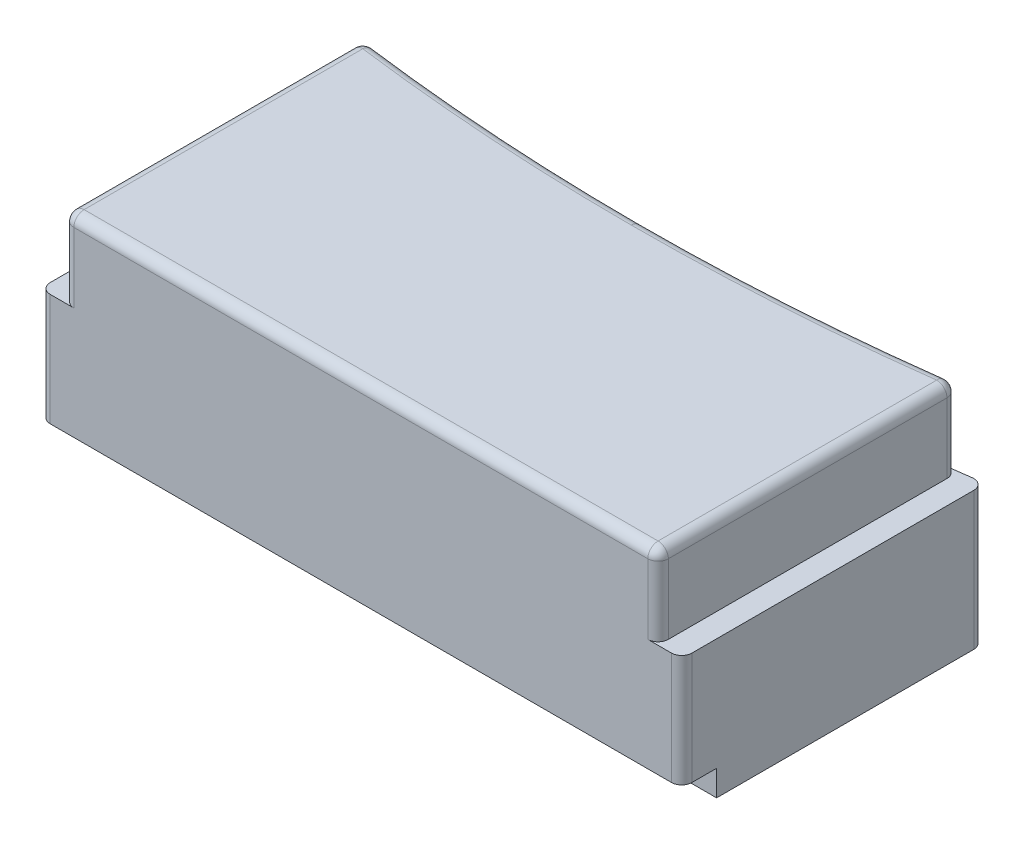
ISO-10303-21;
HEADER;
FILE_DESCRIPTION(('STEP AP214'),'2;1');
FILE_NAME('part.step','',(''),(''),'','','');
FILE_SCHEMA(('AUTOMOTIVE_DESIGN { 1 0 10303 214 1 1 1 1 }'));
ENDSEC;
DATA;
#1=APPLICATION_CONTEXT('core data for automotive mechanical design processes');
#2=APPLICATION_PROTOCOL_DEFINITION('international standard','automotive_design',2000,#1);
#3=PRODUCT_CONTEXT('',#1,'mechanical');
#4=PRODUCT('Part','Part','',(#3));
#5=PRODUCT_RELATED_PRODUCT_CATEGORY('part','',(#4));
#6=PRODUCT_DEFINITION_FORMATION('','',#4);
#7=PRODUCT_DEFINITION_CONTEXT('part definition',#1,'design');
#8=PRODUCT_DEFINITION('design','',#6,#7);
#9=PRODUCT_DEFINITION_SHAPE('','',#8);
#10=(LENGTH_UNIT() NAMED_UNIT(*) SI_UNIT(.MILLI.,.METRE.));
#11=(NAMED_UNIT(*) PLANE_ANGLE_UNIT() SI_UNIT($,.RADIAN.));
#12=(NAMED_UNIT(*) SI_UNIT($,.STERADIAN.) SOLID_ANGLE_UNIT());
#13=UNCERTAINTY_MEASURE_WITH_UNIT(LENGTH_MEASURE(1.E-05),#10,'distance_accuracy_value','');
#14=(GEOMETRIC_REPRESENTATION_CONTEXT(3) GLOBAL_UNCERTAINTY_ASSIGNED_CONTEXT((#13)) GLOBAL_UNIT_ASSIGNED_CONTEXT((#10,
#11,#12)) REPRESENTATION_CONTEXT('',''));
#15=CARTESIAN_POINT('',(0.,0.,0.));
#16=DIRECTION('',(0.,0.,1.));
#17=DIRECTION('',(1.,0.,0.));
#18=AXIS2_PLACEMENT_3D('',#15,#16,#17);
#19=CARTESIAN_POINT('',(-27.9500000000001,9.61,-1.));
#20=DIRECTION('',(1.,0.,0.));
#21=DIRECTION('',(0.,0.,-1.));
#22=AXIS2_PLACEMENT_3D('',#19,#20,#21);
#23=SPHERICAL_SURFACE('',#22,1.);
#24=CARTESIAN_POINT('',(-27.9500000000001,9.61,-1.));
#25=DIRECTION('',(-1.,0.,0.));
#26=DIRECTION('',(0.,0.,1.));
#27=AXIS2_PLACEMENT_3D('',#24,#25,#26);
#28=CIRCLE('',#27,1.);
#29=CARTESIAN_POINT('',(-27.9500000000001,10.61,-1.));
#30=VERTEX_POINT('',#29);
#31=CARTESIAN_POINT('',(-27.9500000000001,9.61,0.));
#32=VERTEX_POINT('',#31);
#33=EDGE_CURVE('E259',#30,#32,#28,.F.);
#34=ORIENTED_EDGE('',*,*,#33,.F.);
#35=CARTESIAN_POINT('',(-27.9500000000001,9.61,-1.));
#36=DIRECTION('',(0.,0.,1.));
#37=DIRECTION('',(1.,0.,0.));
#38=AXIS2_PLACEMENT_3D('',#35,#36,#37);
#39=CIRCLE('',#38,1.);
#40=CARTESIAN_POINT('',(-28.9500000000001,9.61,-1.));
#41=VERTEX_POINT('',#40);
#42=EDGE_CURVE('E258',#41,#30,#39,.F.);
#43=ORIENTED_EDGE('',*,*,#42,.F.);
#44=CARTESIAN_POINT('',(-27.9500000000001,9.61,-1.));
#45=DIRECTION('',(0.,1.,0.));
#46=DIRECTION('',(0.,0.,1.));
#47=AXIS2_PLACEMENT_3D('',#44,#45,#46);
#48=CIRCLE('',#47,1.);
#49=EDGE_CURVE('E233',#32,#41,#48,.F.);
#50=ORIENTED_EDGE('',*,*,#49,.F.);
#51=EDGE_LOOP('',(#34,#43,#50));
#52=FACE_BOUND('',#51,.T.);
#53=ADVANCED_FACE('F39',(#52),#23,.T.);
#54=CARTESIAN_POINT('',(27.9500000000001,9.61,-1.));
#55=DIRECTION('',(1.,0.,0.));
#56=DIRECTION('',(0.,0.,-1.));
#57=AXIS2_PLACEMENT_3D('',#54,#55,#56);
#58=SPHERICAL_SURFACE('',#57,1.);
#59=CARTESIAN_POINT('',(27.9500000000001,9.61,-1.));
#60=DIRECTION('',(0.,1.,0.));
#61=DIRECTION('',(0.,0.,1.));
#62=AXIS2_PLACEMENT_3D('',#59,#60,#61);
#63=CIRCLE('',#62,1.);
#64=CARTESIAN_POINT('',(28.9500000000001,9.61,-1.));
#65=VERTEX_POINT('',#64);
#66=CARTESIAN_POINT('',(27.9500000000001,9.61,0.));
#67=VERTEX_POINT('',#66);
#68=EDGE_CURVE('E600',#65,#67,#63,.F.);
#69=ORIENTED_EDGE('',*,*,#68,.F.);
#70=CARTESIAN_POINT('',(27.9500000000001,9.61,-1.));
#71=DIRECTION('',(0.,0.,-1.));
#72=DIRECTION('',(-1.,0.,0.));
#73=AXIS2_PLACEMENT_3D('',#70,#71,#72);
#74=CIRCLE('',#73,1.);
#75=CARTESIAN_POINT('',(27.9500000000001,10.61,-1.));
#76=VERTEX_POINT('',#75);
#77=EDGE_CURVE('E264',#76,#65,#74,.T.);
#78=ORIENTED_EDGE('',*,*,#77,.F.);
#79=CARTESIAN_POINT('',(27.9500000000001,9.61,-1.));
#80=DIRECTION('',(-1.,0.,0.));
#81=DIRECTION('',(0.,0.,1.));
#82=AXIS2_PLACEMENT_3D('',#79,#80,#81);
#83=CIRCLE('',#82,1.);
#84=EDGE_CURVE('E244',#67,#76,#83,.T.);
#85=ORIENTED_EDGE('',*,*,#84,.F.);
#86=EDGE_LOOP('',(#69,#78,#85));
#87=FACE_BOUND('',#86,.T.);
#88=ADVANCED_FACE('F290',(#87),#58,.T.);
#89=CARTESIAN_POINT('',(27.9500000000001,9.61,0.));
#90=DIRECTION('',(0.,0.,-1.));
#91=DIRECTION('',(-1.,0.,0.));
#92=AXIS2_PLACEMENT_3D('',#89,#90,#91);
#93=CYLINDRICAL_SURFACE('',#92,1.);
#94=CARTESIAN_POINT('',(27.9500000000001,9.61,-28.1372404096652));
#95=DIRECTION('',(0.,0.,1.));
#96=DIRECTION('',(1.,0.,0.));
#97=AXIS2_PLACEMENT_3D('',#94,#95,#96);
#98=CIRCLE('',#97,1.);
#99=CARTESIAN_POINT('',(27.9500000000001,10.61,-28.1372404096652));
#100=VERTEX_POINT('',#99);
#101=CARTESIAN_POINT('',(28.9500000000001,9.61,-28.1372404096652));
#102=VERTEX_POINT('',#101);
#103=EDGE_CURVE('E333',#100,#102,#98,.F.);
#104=ORIENTED_EDGE('',*,*,#103,.F.);
#105=DIRECTION('',(0.,0.,1.));
#106=VECTOR('',#105,1.);
#107=CARTESIAN_POINT('',(27.9500000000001,10.61,-244.338067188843));
#108=LINE('',#107,#106);
#109=EDGE_CURVE('E588',#76,#100,#108,.F.);
#110=ORIENTED_EDGE('',*,*,#109,.F.);
#111=ORIENTED_EDGE('',*,*,#77,.T.);
#112=DIRECTION('',(0.,0.,1.));
#113=VECTOR('',#112,1.);
#114=CARTESIAN_POINT('',(28.9500000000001,9.61,0.));
#115=LINE('',#114,#113);
#116=EDGE_CURVE('E282',#65,#102,#115,.F.);
#117=ORIENTED_EDGE('',*,*,#116,.T.);
#118=EDGE_LOOP('',(#104,#110,#111,#117));
#119=FACE_BOUND('',#118,.T.);
#120=ADVANCED_FACE('F293',(#119),#93,.T.);
#121=CARTESIAN_POINT('',(-27.9500000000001,9.61,0.));
#122=DIRECTION('',(0.,0.,1.));
#123=DIRECTION('',(1.,0.,0.));
#124=AXIS2_PLACEMENT_3D('',#121,#122,#123);
#125=CYLINDRICAL_SURFACE('',#124,1.);
#126=CARTESIAN_POINT('',(-27.9500000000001,9.61,-28.1372404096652));
#127=DIRECTION('',(0.,9.81293437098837E-11,1.));
#128=DIRECTION('',(1.,0.,0.));
#129=AXIS2_PLACEMENT_3D('',#126,#127,#128);
#130=CIRCLE('',#129,1.);
#131=CARTESIAN_POINT('',(-28.9500000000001,9.61,-28.1372404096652));
#132=VERTEX_POINT('',#131);
#133=CARTESIAN_POINT('',(-27.9500000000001,10.61,-28.1372404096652));
#134=VERTEX_POINT('',#133);
#135=EDGE_CURVE('E267',#132,#134,#130,.F.);
#136=ORIENTED_EDGE('',*,*,#135,.F.);
#137=DIRECTION('',(0.,0.,-1.));
#138=VECTOR('',#137,1.);
#139=CARTESIAN_POINT('',(-28.9500000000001,9.61,0.));
#140=LINE('',#139,#138);
#141=EDGE_CURVE('E251',#132,#41,#140,.F.);
#142=ORIENTED_EDGE('',*,*,#141,.T.);
#143=ORIENTED_EDGE('',*,*,#42,.T.);
#144=DIRECTION('',(0.,0.,1.));
#145=VECTOR('',#144,1.);
#146=CARTESIAN_POINT('',(-27.9500000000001,10.61,-244.338067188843));
#147=LINE('',#146,#145);
#148=EDGE_CURVE('E585',#134,#30,#147,.T.);
#149=ORIENTED_EDGE('',*,*,#148,.F.);
#150=EDGE_LOOP('',(#136,#142,#143,#149));
#151=FACE_BOUND('',#150,.T.);
#152=ADVANCED_FACE('F266',(#151),#125,.T.);
#153=CARTESIAN_POINT('',(-27.9500000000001,2.81,-1.));
#154=DIRECTION('',(0.,1.,0.));
#155=DIRECTION('',(0.,0.,1.));
#156=AXIS2_PLACEMENT_3D('',#153,#154,#155);
#157=CYLINDRICAL_SURFACE('',#156,1.);
#158=ORIENTED_EDGE('',*,*,#49,.T.);
#159=DIRECTION('',(0.,1.,0.));
#160=VECTOR('',#159,1.);
#161=CARTESIAN_POINT('',(-28.9500000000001,2.81,-1.));
#162=LINE('',#161,#160);
#163=CARTESIAN_POINT('',(-28.9500000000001,2.81,-1.));
#164=VERTEX_POINT('',#163);
#165=EDGE_CURVE('E236',#41,#164,#162,.F.);
#166=ORIENTED_EDGE('',*,*,#165,.T.);
#167=CARTESIAN_POINT('',(-27.9500000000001,2.81,-1.));
#168=DIRECTION('',(0.,1.,0.));
#169=DIRECTION('',(0.,0.,1.));
#170=AXIS2_PLACEMENT_3D('',#167,#168,#169);
#171=CIRCLE('',#170,1.);
#172=CARTESIAN_POINT('',(-27.9500000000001,2.81,0.));
#173=VERTEX_POINT('',#172);
#174=EDGE_CURVE('E43',#164,#173,#171,.T.);
#175=ORIENTED_EDGE('',*,*,#174,.T.);
#176=DIRECTION('',(0.,1.,0.));
#177=VECTOR('',#176,1.);
#178=CARTESIAN_POINT('',(-27.9500000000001,10.61,0.));
#179=LINE('',#178,#177);
#180=EDGE_CURVE('E238',#173,#32,#179,.T.);
#181=ORIENTED_EDGE('',*,*,#180,.T.);
#182=EDGE_LOOP('',(#158,#166,#175,#181));
#183=FACE_BOUND('',#182,.T.);
#184=ADVANCED_FACE('F235',(#183),#157,.T.);
#185=CARTESIAN_POINT('',(0.,9.61,-1.));
#186=DIRECTION('',(-1.,0.,0.));
#187=DIRECTION('',(0.,0.,1.));
#188=AXIS2_PLACEMENT_3D('',#185,#186,#187);
#189=CYLINDRICAL_SURFACE('',#188,1.);
#190=ORIENTED_EDGE('',*,*,#33,.T.);
#191=DIRECTION('',(-1.,0.,0.));
#192=VECTOR('',#191,1.);
#193=CARTESIAN_POINT('',(-31.25,9.61,0.));
#194=LINE('',#193,#192);
#195=EDGE_CURVE('E274',#32,#67,#194,.F.);
#196=ORIENTED_EDGE('',*,*,#195,.T.);
#197=ORIENTED_EDGE('',*,*,#84,.T.);
#198=DIRECTION('',(1.,0.,0.));
#199=VECTOR('',#198,1.);
#200=CARTESIAN_POINT('',(0.,10.61,-1.));
#201=LINE('',#200,#199);
#202=EDGE_CURVE('E593',#30,#76,#201,.T.);
#203=ORIENTED_EDGE('',*,*,#202,.F.);
#204=EDGE_LOOP('',(#190,#196,#197,#203));
#205=FACE_BOUND('',#204,.T.);
#206=ADVANCED_FACE('F302',(#205),#189,.T.);
#207=CARTESIAN_POINT('',(27.9500000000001,10.61,-1.));
#208=DIRECTION('',(0.,1.,0.));
#209=DIRECTION('',(0.,0.,1.));
#210=AXIS2_PLACEMENT_3D('',#207,#208,#209);
#211=CYLINDRICAL_SURFACE('',#210,1.);
#212=CARTESIAN_POINT('',(27.9500000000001,2.81,-1.));
#213=DIRECTION('',(0.,1.,0.));
#214=DIRECTION('',(0.,0.,1.));
#215=AXIS2_PLACEMENT_3D('',#212,#213,#214);
#216=CIRCLE('',#215,1.);
#217=CARTESIAN_POINT('',(27.9500000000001,2.81,0.));
#218=VERTEX_POINT('',#217);
#219=CARTESIAN_POINT('',(28.9500000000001,2.81,-1.));
#220=VERTEX_POINT('',#219);
#221=EDGE_CURVE('E598',#218,#220,#216,.T.);
#222=ORIENTED_EDGE('',*,*,#221,.T.);
#223=DIRECTION('',(0.,1.,0.));
#224=VECTOR('',#223,1.);
#225=CARTESIAN_POINT('',(28.9500000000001,2.81,-1.));
#226=LINE('',#225,#224);
#227=EDGE_CURVE('E286',#220,#65,#226,.T.);
#228=ORIENTED_EDGE('',*,*,#227,.T.);
#229=ORIENTED_EDGE('',*,*,#68,.T.);
#230=DIRECTION('',(0.,1.,0.));
#231=VECTOR('',#230,1.);
#232=CARTESIAN_POINT('',(27.9500000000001,10.61,0.));
#233=LINE('',#232,#231);
#234=EDGE_CURVE('E425',#67,#218,#233,.F.);
#235=ORIENTED_EDGE('',*,*,#234,.T.);
#236=EDGE_LOOP('',(#222,#228,#229,#235));
#237=FACE_BOUND('',#236,.T.);
#238=ADVANCED_FACE('F305',(#237),#211,.T.);
#239=CARTESIAN_POINT('',(28.9500000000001,2.81,0.));
#240=DIRECTION('',(-1.,0.,0.));
#241=DIRECTION('',(0.,0.,1.));
#242=AXIS2_PLACEMENT_3D('',#239,#240,#241);
#243=PLANE('',#242);
#244=DIRECTION('',(0.,-1.,0.));
#245=VECTOR('',#244,1.);
#246=CARTESIAN_POINT('',(28.9500000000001,10.61,-28.1372404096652));
#247=LINE('',#246,#245);
#248=CARTESIAN_POINT('',(28.9500000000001,2.81,-28.1372404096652));
#249=VERTEX_POINT('',#248);
#250=EDGE_CURVE('E285',#102,#249,#247,.T.);
#251=ORIENTED_EDGE('',*,*,#250,.F.);
#252=ORIENTED_EDGE('',*,*,#116,.F.);
#253=ORIENTED_EDGE('',*,*,#227,.F.);
#254=DIRECTION('',(0.,0.,-1.));
#255=VECTOR('',#254,1.);
#256=CARTESIAN_POINT('',(28.9500000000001,2.81,0.));
#257=LINE('',#256,#255);
#258=EDGE_CURVE('E384',#220,#249,#257,.T.);
#259=ORIENTED_EDGE('',*,*,#258,.T.);
#260=EDGE_LOOP('',(#251,#252,#253,#259));
#261=FACE_BOUND('',#260,.T.);
#262=ADVANCED_FACE('F309',(#261),#243,.F.);
#263=CARTESIAN_POINT('',(27.9500000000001,10.61,-28.1372404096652));
#264=DIRECTION('',(0.,-1.,0.));
#265=DIRECTION('',(0.,0.,-1.));
#266=AXIS2_PLACEMENT_3D('',#263,#264,#265);
#267=CYLINDRICAL_SURFACE('',#266,1.);
#268=ORIENTED_EDGE('',*,*,#250,.T.);
#269=CARTESIAN_POINT('',(27.9500000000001,2.81,-28.1372404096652));
#270=DIRECTION('',(0.,-1.,0.));
#271=DIRECTION('',(0.,0.,-1.));
#272=AXIS2_PLACEMENT_3D('',#269,#270,#271);
#273=CIRCLE('',#272,1.);
#274=CARTESIAN_POINT('',(27.9500000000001,2.81,-29.1372404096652));
#275=VERTEX_POINT('',#274);
#276=EDGE_CURVE('E388',#249,#275,#273,.F.);
#277=ORIENTED_EDGE('',*,*,#276,.T.);
#278=DIRECTION('',(0.,-1.,0.));
#279=VECTOR('',#278,1.);
#280=CARTESIAN_POINT('',(27.9500000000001,10.61,-29.1372404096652));
#281=LINE('',#280,#279);
#282=CARTESIAN_POINT('',(27.9500000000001,9.61,-29.1372404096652));
#283=VERTEX_POINT('',#282);
#284=EDGE_CURVE('E351',#283,#275,#281,.T.);
#285=ORIENTED_EDGE('',*,*,#284,.F.);
#286=CARTESIAN_POINT('',(27.9500000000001,9.61,-28.1372404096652));
#287=DIRECTION('',(0.,1.,0.));
#288=DIRECTION('',(1.,0.,0.));
#289=AXIS2_PLACEMENT_3D('',#286,#287,#288);
#290=CIRCLE('',#289,1.);
#291=EDGE_CURVE('E337',#102,#283,#290,.T.);
#292=ORIENTED_EDGE('',*,*,#291,.F.);
#293=EDGE_LOOP('',(#268,#277,#285,#292));
#294=FACE_BOUND('',#293,.T.);
#295=ADVANCED_FACE('F313',(#294),#267,.T.);
#296=CARTESIAN_POINT('',(27.9500000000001,9.61,-28.1372404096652));
#297=DIRECTION('',(1.,0.,0.));
#298=DIRECTION('',(0.,0.,-1.));
#299=AXIS2_PLACEMENT_3D('',#296,#297,#298);
#300=SPHERICAL_SURFACE('',#299,1.);
#301=CARTESIAN_POINT('',(27.9500000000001,9.61,-28.1372404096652));
#302=DIRECTION('',(0.,-1.,0.));
#303=DIRECTION('',(0.,0.,-1.));
#304=AXIS2_PLACEMENT_3D('',#301,#302,#303);
#305=CIRCLE('',#304,1.);
#306=CARTESIAN_POINT('',(27.8217889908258,9.61,-29.1289873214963));
#307=VERTEX_POINT('',#306);
#308=EDGE_CURVE('E379',#307,#283,#305,.T.);
#309=ORIENTED_EDGE('',*,*,#308,.F.);
#310=CARTESIAN_POINT('',(27.9500000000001,9.61,-28.1372404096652));
#311=DIRECTION('',(0.99174691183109,0.,-0.128211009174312));
#312=DIRECTION('',(0.128211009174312,0.,0.99174691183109));
#313=AXIS2_PLACEMENT_3D('',#310,#311,#312);
#314=CIRCLE('',#313,1.);
#315=EDGE_CURVE('E546',#100,#307,#314,.F.);
#316=ORIENTED_EDGE('',*,*,#315,.F.);
#317=ORIENTED_EDGE('',*,*,#103,.T.);
#318=ORIENTED_EDGE('',*,*,#291,.T.);
#319=EDGE_LOOP('',(#309,#316,#317,#318));
#320=FACE_BOUND('',#319,.T.);
#321=ADVANCED_FACE('F317',(#320),#300,.T.);
#322=CARTESIAN_POINT('',(0.,10.61,-244.338067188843));
#323=DIRECTION('',(0.,1.,0.));
#324=DIRECTION('',(0.,0.,1.));
#325=AXIS2_PLACEMENT_3D('',#322,#323,#324);
#326=PLANE('',#325);
#327=CARTESIAN_POINT('',(0.,10.61,-244.338067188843));
#328=DIRECTION('',(0.,1.,0.));
#329=DIRECTION('',(-0.128211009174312,0.,0.99174691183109));
#330=AXIS2_PLACEMENT_3D('',#327,#328,#329);
#331=CIRCLE('',#330,218.);
#332=CARTESIAN_POINT('',(0.,10.61,-26.3380671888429));
#333=VERTEX_POINT('',#332);
#334=EDGE_CURVE('E537',#134,#333,#331,.T.);
#335=ORIENTED_EDGE('',*,*,#334,.F.);
#336=ORIENTED_EDGE('',*,*,#148,.T.);
#337=ORIENTED_EDGE('',*,*,#202,.T.);
#338=ORIENTED_EDGE('',*,*,#109,.T.);
#339=CARTESIAN_POINT('',(0.,10.61,-244.338067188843));
#340=DIRECTION('',(0.,1.,0.));
#341=DIRECTION('',(0.,0.,1.));
#342=AXIS2_PLACEMENT_3D('',#339,#340,#341);
#343=CIRCLE('',#342,218.);
#344=EDGE_CURVE('E345',#333,#100,#343,.T.);
#345=ORIENTED_EDGE('',*,*,#344,.F.);
#346=EDGE_LOOP('',(#335,#336,#337,#338,#345));
#347=FACE_BOUND('',#346,.T.);
#348=ADVANCED_FACE('F322',(#347),#326,.T.);
#349=CARTESIAN_POINT('',(-27.9500000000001,9.61,-28.1372404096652));
#350=DIRECTION('',(1.,0.,0.));
#351=DIRECTION('',(0.,0.,-1.));
#352=AXIS2_PLACEMENT_3D('',#349,#350,#351);
#353=SPHERICAL_SURFACE('',#352,1.);
#354=CARTESIAN_POINT('',(-27.9500000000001,9.61,-28.1372404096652));
#355=DIRECTION('',(0.,1.,0.));
#356=DIRECTION('',(1.,0.,0.));
#357=AXIS2_PLACEMENT_3D('',#354,#355,#356);
#358=CIRCLE('',#357,1.);
#359=CARTESIAN_POINT('',(-27.8217889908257,9.61,-29.1289873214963));
#360=VERTEX_POINT('',#359);
#361=CARTESIAN_POINT('',(-27.9500000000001,9.61,-29.1372404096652));
#362=VERTEX_POINT('',#361);
#363=EDGE_CURVE('E430',#360,#362,#358,.T.);
#364=ORIENTED_EDGE('',*,*,#363,.T.);
#365=CARTESIAN_POINT('',(-27.9500000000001,9.61,-28.1372404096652));
#366=DIRECTION('',(0.,-1.,0.));
#367=DIRECTION('',(0.,0.,-1.));
#368=AXIS2_PLACEMENT_3D('',#365,#366,#367);
#369=CIRCLE('',#368,1.);
#370=EDGE_CURVE('E426',#132,#362,#369,.T.);
#371=ORIENTED_EDGE('',*,*,#370,.F.);
#372=ORIENTED_EDGE('',*,*,#135,.T.);
#373=CARTESIAN_POINT('',(-27.9500000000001,9.61,-28.1372404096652));
#374=DIRECTION('',(0.99174691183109,0.,0.128211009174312));
#375=DIRECTION('',(-0.128211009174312,0.,0.99174691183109));
#376=AXIS2_PLACEMENT_3D('',#373,#374,#375);
#377=CIRCLE('',#376,1.);
#378=EDGE_CURVE('E420',#360,#134,#377,.T.);
#379=ORIENTED_EDGE('',*,*,#378,.F.);
#380=EDGE_LOOP('',(#364,#371,#372,#379));
#381=FACE_BOUND('',#380,.T.);
#382=ADVANCED_FACE('F434',(#381),#353,.T.);
#383=CARTESIAN_POINT('',(-27.9500000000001,10.61,-28.1372404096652));
#384=DIRECTION('',(0.,-1.,0.));
#385=DIRECTION('',(0.,0.,-1.));
#386=AXIS2_PLACEMENT_3D('',#383,#384,#385);
#387=CYLINDRICAL_SURFACE('',#386,1.);
#388=CARTESIAN_POINT('',(-27.9500000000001,2.81,-28.1372404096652));
#389=DIRECTION('',(0.,-1.,0.));
#390=DIRECTION('',(0.,0.,-1.));
#391=AXIS2_PLACEMENT_3D('',#388,#389,#390);
#392=CIRCLE('',#391,1.);
#393=CARTESIAN_POINT('',(-27.9500000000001,2.81,-29.1372404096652));
#394=VERTEX_POINT('',#393);
#395=CARTESIAN_POINT('',(-28.9500000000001,2.81,-28.1372404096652));
#396=VERTEX_POINT('',#395);
#397=EDGE_CURVE('E256',#394,#396,#392,.F.);
#398=ORIENTED_EDGE('',*,*,#397,.T.);
#399=DIRECTION('',(0.,1.,0.));
#400=VECTOR('',#399,1.);
#401=CARTESIAN_POINT('',(-28.9500000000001,2.81,-28.1372404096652));
#402=LINE('',#401,#400);
#403=EDGE_CURVE('E255',#396,#132,#402,.T.);
#404=ORIENTED_EDGE('',*,*,#403,.T.);
#405=ORIENTED_EDGE('',*,*,#370,.T.);
#406=DIRECTION('',(0.,-1.,0.));
#407=VECTOR('',#406,1.);
#408=CARTESIAN_POINT('',(-27.9500000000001,10.61,-29.1372404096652));
#409=LINE('',#408,#407);
#410=EDGE_CURVE('E416',#394,#362,#409,.F.);
#411=ORIENTED_EDGE('',*,*,#410,.F.);
#412=EDGE_LOOP('',(#398,#404,#405,#411));
#413=FACE_BOUND('',#412,.T.);
#414=ADVANCED_FACE('F437',(#413),#387,.T.);
#415=CARTESIAN_POINT('',(-28.9500000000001,2.81,0.));
#416=DIRECTION('',(1.,0.,0.));
#417=DIRECTION('',(0.,0.,-1.));
#418=AXIS2_PLACEMENT_3D('',#415,#416,#417);
#419=PLANE('',#418);
#420=ORIENTED_EDGE('',*,*,#403,.F.);
#421=DIRECTION('',(0.,0.,-1.));
#422=VECTOR('',#421,1.);
#423=CARTESIAN_POINT('',(-28.9500000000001,2.81,0.));
#424=LINE('',#423,#422);
#425=EDGE_CURVE('E253',#396,#164,#424,.F.);
#426=ORIENTED_EDGE('',*,*,#425,.T.);
#427=ORIENTED_EDGE('',*,*,#165,.F.);
#428=ORIENTED_EDGE('',*,*,#141,.F.);
#429=EDGE_LOOP('',(#420,#426,#427,#428));
#430=FACE_BOUND('',#429,.T.);
#431=ADVANCED_FACE('F249',(#430),#419,.F.);
#432=CARTESIAN_POINT('',(-31.25,10.61,0.));
#433=DIRECTION('',(0.,0.,-1.));
#434=DIRECTION('',(-1.,0.,0.));
#435=AXIS2_PLACEMENT_3D('',#432,#433,#434);
#436=PLANE('',#435);
#437=DIRECTION('',(0.,-1.,0.));
#438=VECTOR('',#437,1.);
#439=CARTESIAN_POINT('',(-30.25,10.61,0.));
#440=LINE('',#439,#438);
#441=CARTESIAN_POINT('',(-30.25,-8.11,0.));
#442=VERTEX_POINT('',#441);
#443=CARTESIAN_POINT('',(-30.25,2.81,0.));
#444=VERTEX_POINT('',#443);
#445=EDGE_CURVE('E166',#442,#444,#440,.F.);
#446=ORIENTED_EDGE('',*,*,#445,.F.);
#447=DIRECTION('',(1.,0.,0.));
#448=VECTOR('',#447,1.);
#449=CARTESIAN_POINT('',(-31.2500000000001,-8.11,0.));
#450=LINE('',#449,#448);
#451=CARTESIAN_POINT('',(30.25,-8.11,0.));
#452=VERTEX_POINT('',#451);
#453=EDGE_CURVE('E411',#442,#452,#450,.T.);
#454=ORIENTED_EDGE('',*,*,#453,.T.);
#455=DIRECTION('',(0.,-1.,0.));
#456=VECTOR('',#455,1.);
#457=CARTESIAN_POINT('',(30.25,10.61,0.));
#458=LINE('',#457,#456);
#459=CARTESIAN_POINT('',(30.25,2.81,0.));
#460=VERTEX_POINT('',#459);
#461=EDGE_CURVE('E421',#460,#452,#458,.T.);
#462=ORIENTED_EDGE('',*,*,#461,.F.);
#463=DIRECTION('',(1.,0.,0.));
#464=VECTOR('',#463,1.);
#465=CARTESIAN_POINT('',(0.,2.81,0.));
#466=LINE('',#465,#464);
#467=EDGE_CURVE('E389',#460,#218,#466,.F.);
#468=ORIENTED_EDGE('',*,*,#467,.T.);
#469=ORIENTED_EDGE('',*,*,#234,.F.);
#470=ORIENTED_EDGE('',*,*,#195,.F.);
#471=ORIENTED_EDGE('',*,*,#180,.F.);
#472=DIRECTION('',(1.,0.,0.));
#473=VECTOR('',#472,1.);
#474=CARTESIAN_POINT('',(0.,2.81,0.));
#475=LINE('',#474,#473);
#476=EDGE_CURVE('E653',#173,#444,#475,.F.);
#477=ORIENTED_EDGE('',*,*,#476,.T.);
#478=EDGE_LOOP('',(#446,#454,#462,#468,#469,#470,#471,#477));
#479=FACE_BOUND('',#478,.T.);
#480=ADVANCED_FACE('F444',(#479),#436,.F.);
#481=CARTESIAN_POINT('',(30.25,10.61,-1.));
#482=DIRECTION('',(0.,-1.,0.));
#483=DIRECTION('',(0.,0.,-1.));
#484=AXIS2_PLACEMENT_3D('',#481,#482,#483);
#485=CYLINDRICAL_SURFACE('',#484,1.);
#486=CARTESIAN_POINT('',(30.25,-8.11,-1.));
#487=DIRECTION('',(0.,-1.,0.));
#488=DIRECTION('',(0.,0.,-1.));
#489=AXIS2_PLACEMENT_3D('',#486,#487,#488);
#490=CIRCLE('',#489,1.);
#491=CARTESIAN_POINT('',(31.25,-8.11,-1.));
#492=VERTEX_POINT('',#491);
#493=EDGE_CURVE('E413',#452,#492,#490,.F.);
#494=ORIENTED_EDGE('',*,*,#493,.T.);
#495=DIRECTION('',(0.,1.,0.));
#496=VECTOR('',#495,1.);
#497=CARTESIAN_POINT('',(31.25,10.61,-1.));
#498=LINE('',#497,#496);
#499=CARTESIAN_POINT('',(31.25,2.81,-1.));
#500=VERTEX_POINT('',#499);
#501=EDGE_CURVE('E399',#492,#500,#498,.T.);
#502=ORIENTED_EDGE('',*,*,#501,.T.);
#503=CARTESIAN_POINT('',(30.25,2.81,-1.));
#504=DIRECTION('',(0.,-1.,0.));
#505=DIRECTION('',(0.,0.,-1.));
#506=AXIS2_PLACEMENT_3D('',#503,#504,#505);
#507=CIRCLE('',#506,1.);
#508=EDGE_CURVE('E393',#500,#460,#507,.T.);
#509=ORIENTED_EDGE('',*,*,#508,.T.);
#510=ORIENTED_EDGE('',*,*,#461,.T.);
#511=EDGE_LOOP('',(#494,#502,#509,#510));
#512=FACE_BOUND('',#511,.T.);
#513=ADVANCED_FACE('F447',(#512),#485,.T.);
#514=CARTESIAN_POINT('',(30.25,10.61,-28.4470356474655));
#515=DIRECTION('',(0.,-1.,0.));
#516=DIRECTION('',(0.,0.,-1.));
#517=AXIS2_PLACEMENT_3D('',#514,#515,#516);
#518=CYLINDRICAL_SURFACE('',#517,1.);
#519=DIRECTION('',(0.,1.,0.));
#520=VECTOR('',#519,1.);
#521=CARTESIAN_POINT('',(31.25,10.61,-28.4470356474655));
#522=LINE('',#521,#520);
#523=CARTESIAN_POINT('',(31.25,2.81,-28.4470356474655));
#524=VERTEX_POINT('',#523);
#525=CARTESIAN_POINT('',(31.25,-10.61,-28.4470356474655));
#526=VERTEX_POINT('',#525);
#527=EDGE_CURVE('E398',#524,#526,#522,.F.);
#528=ORIENTED_EDGE('',*,*,#527,.T.);
#529=CARTESIAN_POINT('',(30.25,-10.61,-28.4470356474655));
#530=DIRECTION('',(0.,-1.,0.));
#531=DIRECTION('',(0.,0.,-1.));
#532=AXIS2_PLACEMENT_3D('',#529,#530,#531);
#533=CIRCLE('',#532,1.);
#534=CARTESIAN_POINT('',(30.25,-10.61,-29.4470356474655));
#535=VERTEX_POINT('',#534);
#536=EDGE_CURVE('E424',#526,#535,#533,.F.);
#537=ORIENTED_EDGE('',*,*,#536,.T.);
#538=DIRECTION('',(0.,-1.,0.));
#539=VECTOR('',#538,1.);
#540=CARTESIAN_POINT('',(30.25,10.61,-29.4470356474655));
#541=LINE('',#540,#539);
#542=CARTESIAN_POINT('',(30.25,2.81,-29.4470356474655));
#543=VERTEX_POINT('',#542);
#544=EDGE_CURVE('E580',#543,#535,#541,.T.);
#545=ORIENTED_EDGE('',*,*,#544,.F.);
#546=CARTESIAN_POINT('',(30.25,2.81,-28.4470356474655));
#547=DIRECTION('',(0.,-1.,0.));
#548=DIRECTION('',(0.,0.,-1.));
#549=AXIS2_PLACEMENT_3D('',#546,#547,#548);
#550=CIRCLE('',#549,1.);
#551=EDGE_CURVE('E383',#543,#524,#550,.T.);
#552=ORIENTED_EDGE('',*,*,#551,.T.);
#553=EDGE_LOOP('',(#528,#537,#545,#552));
#554=FACE_BOUND('',#553,.T.);
#555=ADVANCED_FACE('F451',(#554),#518,.T.);
#556=CARTESIAN_POINT('',(30.25,10.61,-28.4470356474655));
#557=DIRECTION('',(0.,-1.,0.));
#558=DIRECTION('',(0.,0.,-1.));
#559=AXIS2_PLACEMENT_3D('',#556,#557,#558);
#560=CYLINDRICAL_SURFACE('',#559,1.);
#561=CARTESIAN_POINT('',(30.25,-10.61,-28.4470356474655));
#562=DIRECTION('',(0.,-1.,0.));
#563=DIRECTION('',(0.,0.,-1.));
#564=AXIS2_PLACEMENT_3D('',#561,#562,#563);
#565=CIRCLE('',#564,1.);
#566=CARTESIAN_POINT('',(30.1112385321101,-10.61,-29.4373614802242));
#567=VERTEX_POINT('',#566);
#568=EDGE_CURVE('E577',#535,#567,#565,.F.);
#569=ORIENTED_EDGE('',*,*,#568,.T.);
#570=DIRECTION('',(0.,-1.,0.));
#571=VECTOR('',#570,1.);
#572=CARTESIAN_POINT('',(30.1112385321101,10.61,-29.4373614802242));
#573=LINE('',#572,#571);
#574=CARTESIAN_POINT('',(30.1112385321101,2.81,-29.4373614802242));
#575=VERTEX_POINT('',#574);
#576=EDGE_CURVE('E640',#567,#575,#573,.F.);
#577=ORIENTED_EDGE('',*,*,#576,.T.);
#578=CARTESIAN_POINT('',(30.25,2.81,-28.4470356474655));
#579=DIRECTION('',(0.,-1.,0.));
#580=DIRECTION('',(0.,0.,-1.));
#581=AXIS2_PLACEMENT_3D('',#578,#579,#580);
#582=CIRCLE('',#581,1.);
#583=EDGE_CURVE('E567',#575,#543,#582,.T.);
#584=ORIENTED_EDGE('',*,*,#583,.T.);
#585=ORIENTED_EDGE('',*,*,#544,.T.);
#586=EDGE_LOOP('',(#569,#577,#584,#585));
#587=FACE_BOUND('',#586,.T.);
#588=ADVANCED_FACE('F455',(#587),#560,.T.);
#589=CARTESIAN_POINT('',(0.,2.81,0.));
#590=DIRECTION('',(0.,-1.,0.));
#591=DIRECTION('',(0.,0.,-1.));
#592=AXIS2_PLACEMENT_3D('',#589,#590,#591);
#593=PLANE('',#592);
#594=ORIENTED_EDGE('',*,*,#551,.F.);
#595=ORIENTED_EDGE('',*,*,#583,.F.);
#596=CARTESIAN_POINT('',(0.,2.81,-244.338067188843));
#597=DIRECTION('',(0.,-1.,0.));
#598=DIRECTION('',(0.,0.,-1.));
#599=AXIS2_PLACEMENT_3D('',#596,#597,#598);
#600=CIRCLE('',#599,217.);
#601=CARTESIAN_POINT('',(27.8217889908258,2.81,-29.1289873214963));
#602=VERTEX_POINT('',#601);
#603=EDGE_CURVE('E378',#575,#602,#600,.T.);
#604=ORIENTED_EDGE('',*,*,#603,.T.);
#605=CARTESIAN_POINT('',(27.9500000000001,2.81,-28.1372404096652));
#606=DIRECTION('',(0.,-1.,0.));
#607=DIRECTION('',(0.,0.,-1.));
#608=AXIS2_PLACEMENT_3D('',#605,#606,#607);
#609=CIRCLE('',#608,1.);
#610=EDGE_CURVE('E558',#275,#602,#609,.F.);
#611=ORIENTED_EDGE('',*,*,#610,.F.);
#612=ORIENTED_EDGE('',*,*,#276,.F.);
#613=ORIENTED_EDGE('',*,*,#258,.F.);
#614=ORIENTED_EDGE('',*,*,#221,.F.);
#615=ORIENTED_EDGE('',*,*,#467,.F.);
#616=ORIENTED_EDGE('',*,*,#508,.F.);
#617=DIRECTION('',(0.,0.,1.));
#618=VECTOR('',#617,1.);
#619=CARTESIAN_POINT('',(31.25,2.81,0.));
#620=LINE('',#619,#618);
#621=EDGE_CURVE('E394',#500,#524,#620,.F.);
#622=ORIENTED_EDGE('',*,*,#621,.T.);
#623=EDGE_LOOP('',(#594,#595,#604,#611,#612,#613,#614,#615,#616,#622));
#624=FACE_BOUND('',#623,.T.);
#625=ADVANCED_FACE('F458',(#624),#593,.F.);
#626=CARTESIAN_POINT('',(27.9500000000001,10.61,-28.1372404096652));
#627=DIRECTION('',(0.,-1.,0.));
#628=DIRECTION('',(0.,0.,-1.));
#629=AXIS2_PLACEMENT_3D('',#626,#627,#628);
#630=CYLINDRICAL_SURFACE('',#629,1.);
#631=ORIENTED_EDGE('',*,*,#610,.T.);
#632=DIRECTION('',(0.,-1.,0.));
#633=VECTOR('',#632,1.);
#634=CARTESIAN_POINT('',(27.8217889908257,10.61,-29.1289873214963));
#635=LINE('',#634,#633);
#636=EDGE_CURVE('E374',#602,#307,#635,.F.);
#637=ORIENTED_EDGE('',*,*,#636,.T.);
#638=ORIENTED_EDGE('',*,*,#308,.T.);
#639=ORIENTED_EDGE('',*,*,#284,.T.);
#640=EDGE_LOOP('',(#631,#637,#638,#639));
#641=FACE_BOUND('',#640,.T.);
#642=ADVANCED_FACE('F364',(#641),#630,.T.);
#643=CARTESIAN_POINT('',(0.,9.61,-244.338067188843));
#644=DIRECTION('',(0.,1.,0.));
#645=DIRECTION('',(0.,0.,1.));
#646=AXIS2_PLACEMENT_3D('',#643,#644,#645);
#647=TOROIDAL_SURFACE('',#646,218.,1.);
#648=ORIENTED_EDGE('',*,*,#315,.T.);
#649=CARTESIAN_POINT('',(0.,9.61,-244.338067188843));
#650=DIRECTION('',(0.,-1.,0.));
#651=DIRECTION('',(0.,0.,-1.));
#652=AXIS2_PLACEMENT_3D('',#649,#650,#651);
#653=CIRCLE('',#652,217.);
#654=CARTESIAN_POINT('',(0.,9.61,-27.3380671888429));
#655=VERTEX_POINT('',#654);
#656=EDGE_CURVE('E372',#307,#655,#653,.T.);
#657=ORIENTED_EDGE('',*,*,#656,.T.);
#658=CARTESIAN_POINT('',(0.,9.61,-26.3380671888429));
#659=DIRECTION('',(1.,0.,0.));
#660=DIRECTION('',(0.,0.,1.));
#661=AXIS2_PLACEMENT_3D('',#658,#659,#660);
#662=CIRCLE('',#661,1.);
#663=EDGE_CURVE('E535',#333,#655,#662,.F.);
#664=ORIENTED_EDGE('',*,*,#663,.F.);
#665=ORIENTED_EDGE('',*,*,#344,.T.);
#666=EDGE_LOOP('',(#648,#657,#664,#665));
#667=FACE_BOUND('',#666,.T.);
#668=ADVANCED_FACE('F353',(#667),#647,.T.);
#669=CARTESIAN_POINT('',(0.,9.61,-244.338067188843));
#670=DIRECTION('',(0.,1.,0.));
#671=DIRECTION('',(0.,0.,1.));
#672=AXIS2_PLACEMENT_3D('',#669,#670,#671);
#673=TOROIDAL_SURFACE('',#672,218.,1.);
#674=CARTESIAN_POINT('',(0.,9.61,-244.338067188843));
#675=DIRECTION('',(0.,-1.,0.));
#676=DIRECTION('',(0.,0.,-1.));
#677=AXIS2_PLACEMENT_3D('',#674,#675,#676);
#678=CIRCLE('',#677,217.);
#679=EDGE_CURVE('E521',#655,#360,#678,.T.);
#680=ORIENTED_EDGE('',*,*,#679,.T.);
#681=ORIENTED_EDGE('',*,*,#378,.T.);
#682=ORIENTED_EDGE('',*,*,#334,.T.);
#683=ORIENTED_EDGE('',*,*,#663,.T.);
#684=EDGE_LOOP('',(#680,#681,#682,#683));
#685=FACE_BOUND('',#684,.T.);
#686=ADVANCED_FACE('F363',(#685),#673,.T.);
#687=CARTESIAN_POINT('',(-27.9500000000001,10.61,-28.1372404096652));
#688=DIRECTION('',(0.,-1.,0.));
#689=DIRECTION('',(0.,0.,-1.));
#690=AXIS2_PLACEMENT_3D('',#687,#688,#689);
#691=CYLINDRICAL_SURFACE('',#690,1.);
#692=DIRECTION('',(0.,-1.,0.));
#693=VECTOR('',#692,1.);
#694=CARTESIAN_POINT('',(-27.8217889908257,10.61,-29.1289873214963));
#695=LINE('',#694,#693);
#696=CARTESIAN_POINT('',(-27.8217889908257,2.81,-29.1289873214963));
#697=VERTEX_POINT('',#696);
#698=EDGE_CURVE('E513',#360,#697,#695,.T.);
#699=ORIENTED_EDGE('',*,*,#698,.T.);
#700=CARTESIAN_POINT('',(-27.9500000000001,2.81,-28.1372404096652));
#701=DIRECTION('',(0.,-1.,0.));
#702=DIRECTION('',(0.,0.,-1.));
#703=AXIS2_PLACEMENT_3D('',#700,#701,#702);
#704=CIRCLE('',#703,1.);
#705=EDGE_CURVE('E514',#697,#394,#704,.F.);
#706=ORIENTED_EDGE('',*,*,#705,.T.);
#707=ORIENTED_EDGE('',*,*,#410,.T.);
#708=ORIENTED_EDGE('',*,*,#363,.F.);
#709=EDGE_LOOP('',(#699,#706,#707,#708));
#710=FACE_BOUND('',#709,.T.);
#711=ADVANCED_FACE('F503',(#710),#691,.T.);
#712=CARTESIAN_POINT('',(-30.25,10.61,-28.4470356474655));
#713=DIRECTION('',(0.,-1.,0.));
#714=DIRECTION('',(0.,0.,-1.));
#715=AXIS2_PLACEMENT_3D('',#712,#713,#714);
#716=CYLINDRICAL_SURFACE('',#715,1.);
#717=DIRECTION('',(0.,-1.,0.));
#718=VECTOR('',#717,1.);
#719=CARTESIAN_POINT('',(-30.1112385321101,10.61,-29.4373614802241));
#720=LINE('',#719,#718);
#721=CARTESIAN_POINT('',(-30.1112385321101,2.81,-29.4373614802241));
#722=VERTEX_POINT('',#721);
#723=CARTESIAN_POINT('',(-30.1112385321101,-10.61,-29.4373614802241));
#724=VERTEX_POINT('',#723);
#725=EDGE_CURVE('E528',#722,#724,#720,.T.);
#726=ORIENTED_EDGE('',*,*,#725,.T.);
#727=CARTESIAN_POINT('',(-30.25,-10.61,-28.4470356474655));
#728=DIRECTION('',(0.,-1.,0.));
#729=DIRECTION('',(0.,0.,-1.));
#730=AXIS2_PLACEMENT_3D('',#727,#728,#729);
#731=CIRCLE('',#730,1.);
#732=CARTESIAN_POINT('',(-30.25,-10.61,-29.4470356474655));
#733=VERTEX_POINT('',#732);
#734=EDGE_CURVE('E414',#724,#733,#731,.F.);
#735=ORIENTED_EDGE('',*,*,#734,.T.);
#736=DIRECTION('',(0.,-1.,0.));
#737=VECTOR('',#736,1.);
#738=CARTESIAN_POINT('',(-30.25,10.61,-29.4470356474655));
#739=LINE('',#738,#737);
#740=CARTESIAN_POINT('',(-30.25,2.81,-29.4470356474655));
#741=VERTEX_POINT('',#740);
#742=EDGE_CURVE('E408',#741,#733,#739,.T.);
#743=ORIENTED_EDGE('',*,*,#742,.F.);
#744=CARTESIAN_POINT('',(-30.25,2.81,-28.4470356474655));
#745=DIRECTION('',(0.,-1.,0.));
#746=DIRECTION('',(0.,0.,-1.));
#747=AXIS2_PLACEMENT_3D('',#744,#745,#746);
#748=CIRCLE('',#747,1.);
#749=EDGE_CURVE('E183',#741,#722,#748,.T.);
#750=ORIENTED_EDGE('',*,*,#749,.T.);
#751=EDGE_LOOP('',(#726,#735,#743,#750));
#752=FACE_BOUND('',#751,.T.);
#753=ADVANCED_FACE('F501',(#752),#716,.T.);
#754=CARTESIAN_POINT('',(-30.25,10.61,-1.));
#755=DIRECTION('',(0.,-1.,0.));
#756=DIRECTION('',(0.,0.,-1.));
#757=AXIS2_PLACEMENT_3D('',#754,#755,#756);
#758=CYLINDRICAL_SURFACE('',#757,1.);
#759=CARTESIAN_POINT('',(-30.25,-8.11,-1.));
#760=DIRECTION('',(0.,-1.,0.));
#761=DIRECTION('',(0.,0.,-1.));
#762=AXIS2_PLACEMENT_3D('',#759,#760,#761);
#763=CIRCLE('',#762,1.);
#764=CARTESIAN_POINT('',(-31.25,-8.11,-1.));
#765=VERTEX_POINT('',#764);
#766=EDGE_CURVE('E658',#765,#442,#763,.F.);
#767=ORIENTED_EDGE('',*,*,#766,.T.);
#768=ORIENTED_EDGE('',*,*,#445,.T.);
#769=CARTESIAN_POINT('',(-30.25,2.81,-1.));
#770=DIRECTION('',(0.,-1.,0.));
#771=DIRECTION('',(0.,0.,-1.));
#772=AXIS2_PLACEMENT_3D('',#769,#770,#771);
#773=CIRCLE('',#772,1.);
#774=CARTESIAN_POINT('',(-31.25,2.81,-1.));
#775=VERTEX_POINT('',#774);
#776=EDGE_CURVE('E650',#444,#775,#773,.T.);
#777=ORIENTED_EDGE('',*,*,#776,.T.);
#778=DIRECTION('',(0.,1.,0.));
#779=VECTOR('',#778,1.);
#780=CARTESIAN_POINT('',(-31.25,10.61,-1.));
#781=LINE('',#780,#779);
#782=EDGE_CURVE('E177',#775,#765,#781,.F.);
#783=ORIENTED_EDGE('',*,*,#782,.T.);
#784=EDGE_LOOP('',(#767,#768,#777,#783));
#785=FACE_BOUND('',#784,.T.);
#786=ADVANCED_FACE('F497',(#785),#758,.T.);
#787=CARTESIAN_POINT('',(-31.2500000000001,-8.11,0.));
#788=DIRECTION('',(0.,1.,0.));
#789=DIRECTION('',(0.,0.,1.));
#790=AXIS2_PLACEMENT_3D('',#787,#788,#789);
#791=PLANE('',#790);
#792=ORIENTED_EDGE('',*,*,#766,.F.);
#793=DIRECTION('',(0.,0.,-1.));
#794=VECTOR('',#793,1.);
#795=CARTESIAN_POINT('',(-31.25,-8.11,0.));
#796=LINE('',#795,#794);
#797=CARTESIAN_POINT('',(-31.25,-8.11,-3.4));
#798=VERTEX_POINT('',#797);
#799=EDGE_CURVE('E683',#765,#798,#796,.T.);
#800=ORIENTED_EDGE('',*,*,#799,.T.);
#801=DIRECTION('',(-1.,0.,0.));
#802=VECTOR('',#801,1.);
#803=CARTESIAN_POINT('',(-31.2500000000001,-8.11,-3.4));
#804=LINE('',#803,#802);
#805=CARTESIAN_POINT('',(31.25,-8.11,-3.4));
#806=VERTEX_POINT('',#805);
#807=EDGE_CURVE('E203',#798,#806,#804,.F.);
#808=ORIENTED_EDGE('',*,*,#807,.T.);
#809=DIRECTION('',(0.,0.,1.));
#810=VECTOR('',#809,1.);
#811=CARTESIAN_POINT('',(31.25,-8.11,0.));
#812=LINE('',#811,#810);
#813=EDGE_CURVE('E403',#806,#492,#812,.T.);
#814=ORIENTED_EDGE('',*,*,#813,.T.);
#815=ORIENTED_EDGE('',*,*,#493,.F.);
#816=ORIENTED_EDGE('',*,*,#453,.F.);
#817=EDGE_LOOP('',(#792,#800,#808,#814,#815,#816));
#818=FACE_BOUND('',#817,.T.);
#819=ADVANCED_FACE('F494',(#818),#791,.F.);
#820=CARTESIAN_POINT('',(-30.25,10.61,-28.4470356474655));
#821=DIRECTION('',(0.,-1.,0.));
#822=DIRECTION('',(0.,0.,-1.));
#823=AXIS2_PLACEMENT_3D('',#820,#821,#822);
#824=CYLINDRICAL_SURFACE('',#823,1.);
#825=CARTESIAN_POINT('',(-30.25,-10.61,-28.4470356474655));
#826=DIRECTION('',(0.,-1.,0.));
#827=DIRECTION('',(0.,0.,-1.));
#828=AXIS2_PLACEMENT_3D('',#825,#826,#827);
#829=CIRCLE('',#828,1.);
#830=CARTESIAN_POINT('',(-31.25,-10.61,-28.4470356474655));
#831=VERTEX_POINT('',#830);
#832=EDGE_CURVE('E59',#733,#831,#829,.F.);
#833=ORIENTED_EDGE('',*,*,#832,.T.);
#834=DIRECTION('',(0.,1.,0.));
#835=VECTOR('',#834,1.);
#836=CARTESIAN_POINT('',(-31.25,10.61,-28.4470356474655));
#837=LINE('',#836,#835);
#838=CARTESIAN_POINT('',(-31.25,2.81,-28.4470356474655));
#839=VERTEX_POINT('',#838);
#840=EDGE_CURVE('E673',#831,#839,#837,.T.);
#841=ORIENTED_EDGE('',*,*,#840,.T.);
#842=CARTESIAN_POINT('',(-30.25,2.81,-28.4470356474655));
#843=DIRECTION('',(0.,-1.,0.));
#844=DIRECTION('',(0.,0.,-1.));
#845=AXIS2_PLACEMENT_3D('',#842,#843,#844);
#846=CIRCLE('',#845,1.);
#847=EDGE_CURVE('E194',#839,#741,#846,.T.);
#848=ORIENTED_EDGE('',*,*,#847,.T.);
#849=ORIENTED_EDGE('',*,*,#742,.T.);
#850=EDGE_LOOP('',(#833,#841,#848,#849));
#851=FACE_BOUND('',#850,.T.);
#852=ADVANCED_FACE('F491',(#851),#824,.T.);
#853=CARTESIAN_POINT('',(0.,2.81,0.));
#854=DIRECTION('',(0.,-1.,0.));
#855=DIRECTION('',(0.,0.,-1.));
#856=AXIS2_PLACEMENT_3D('',#853,#854,#855);
#857=PLANE('',#856);
#858=ORIENTED_EDGE('',*,*,#749,.F.);
#859=ORIENTED_EDGE('',*,*,#847,.F.);
#860=DIRECTION('',(0.,0.,-1.));
#861=VECTOR('',#860,1.);
#862=CARTESIAN_POINT('',(-31.25,2.81,0.));
#863=LINE('',#862,#861);
#864=EDGE_CURVE('E674',#839,#775,#863,.F.);
#865=ORIENTED_EDGE('',*,*,#864,.T.);
#866=ORIENTED_EDGE('',*,*,#776,.F.);
#867=ORIENTED_EDGE('',*,*,#476,.F.);
#868=ORIENTED_EDGE('',*,*,#174,.F.);
#869=ORIENTED_EDGE('',*,*,#425,.F.);
#870=ORIENTED_EDGE('',*,*,#397,.F.);
#871=ORIENTED_EDGE('',*,*,#705,.F.);
#872=CARTESIAN_POINT('',(0.,2.81,-244.338067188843));
#873=DIRECTION('',(0.,-1.,0.));
#874=DIRECTION('',(0.,0.,-1.));
#875=AXIS2_PLACEMENT_3D('',#872,#873,#874);
#876=CIRCLE('',#875,217.);
#877=EDGE_CURVE('E520',#697,#722,#876,.T.);
#878=ORIENTED_EDGE('',*,*,#877,.T.);
#879=EDGE_LOOP('',(#858,#859,#865,#866,#867,#868,#869,#870,#871,#878));
#880=FACE_BOUND('',#879,.T.);
#881=ADVANCED_FACE('F488',(#880),#857,.F.);
#882=CARTESIAN_POINT('',(-31.2500000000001,-10.61,-3.4));
#883=DIRECTION('',(0.,0.,-1.));
#884=DIRECTION('',(-1.,0.,0.));
#885=AXIS2_PLACEMENT_3D('',#882,#883,#884);
#886=PLANE('',#885);
#887=ORIENTED_EDGE('',*,*,#807,.F.);
#888=DIRECTION('',(0.,1.,0.));
#889=VECTOR('',#888,1.);
#890=CARTESIAN_POINT('',(-31.25,10.61,-3.4));
#891=LINE('',#890,#889);
#892=CARTESIAN_POINT('',(-31.25,-10.61,-3.39999999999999));
#893=VERTEX_POINT('',#892);
#894=EDGE_CURVE('E671',#798,#893,#891,.F.);
#895=ORIENTED_EDGE('',*,*,#894,.T.);
#896=DIRECTION('',(1.,0.,0.));
#897=VECTOR('',#896,1.);
#898=CARTESIAN_POINT('',(0.,-10.61,-3.39999999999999));
#899=LINE('',#898,#897);
#900=CARTESIAN_POINT('',(31.25,-10.61,-3.39999999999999));
#901=VERTEX_POINT('',#900);
#902=EDGE_CURVE('E670',#893,#901,#899,.T.);
#903=ORIENTED_EDGE('',*,*,#902,.T.);
#904=DIRECTION('',(0.,1.,0.));
#905=VECTOR('',#904,1.);
#906=CARTESIAN_POINT('',(31.25,10.61,-3.4));
#907=LINE('',#906,#905);
#908=EDGE_CURVE('E407',#901,#806,#907,.T.);
#909=ORIENTED_EDGE('',*,*,#908,.T.);
#910=EDGE_LOOP('',(#887,#895,#903,#909));
#911=FACE_BOUND('',#910,.T.);
#912=ADVANCED_FACE('F484',(#911),#886,.F.);
#913=CARTESIAN_POINT('',(31.25,10.61,0.));
#914=DIRECTION('',(-1.,0.,0.));
#915=DIRECTION('',(0.,0.,1.));
#916=AXIS2_PLACEMENT_3D('',#913,#914,#915);
#917=PLANE('',#916);
#918=ORIENTED_EDGE('',*,*,#527,.F.);
#919=ORIENTED_EDGE('',*,*,#621,.F.);
#920=ORIENTED_EDGE('',*,*,#501,.F.);
#921=ORIENTED_EDGE('',*,*,#813,.F.);
#922=ORIENTED_EDGE('',*,*,#908,.F.);
#923=DIRECTION('',(0.,0.,1.));
#924=VECTOR('',#923,1.);
#925=CARTESIAN_POINT('',(31.25,-10.61,-244.338067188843));
#926=LINE('',#925,#924);
#927=EDGE_CURVE('E686',#901,#526,#926,.F.);
#928=ORIENTED_EDGE('',*,*,#927,.T.);
#929=EDGE_LOOP('',(#918,#919,#920,#921,#922,#928));
#930=FACE_BOUND('',#929,.T.);
#931=ADVANCED_FACE('F480',(#930),#917,.F.);
#932=CARTESIAN_POINT('',(0.,10.61,-244.338067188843));
#933=DIRECTION('',(0.,-1.,0.));
#934=DIRECTION('',(0.,0.,-1.));
#935=AXIS2_PLACEMENT_3D('',#932,#933,#934);
#936=CYLINDRICAL_SURFACE('',#935,217.);
#937=ORIENTED_EDGE('',*,*,#725,.F.);
#938=ORIENTED_EDGE('',*,*,#877,.F.);
#939=ORIENTED_EDGE('',*,*,#698,.F.);
#940=ORIENTED_EDGE('',*,*,#679,.F.);
#941=ORIENTED_EDGE('',*,*,#656,.F.);
#942=ORIENTED_EDGE('',*,*,#636,.F.);
#943=ORIENTED_EDGE('',*,*,#603,.F.);
#944=ORIENTED_EDGE('',*,*,#576,.F.);
#945=CARTESIAN_POINT('',(0.,-10.61,-244.338067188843));
#946=DIRECTION('',(0.,-1.,0.));
#947=DIRECTION('',(0.,0.,-1.));
#948=AXIS2_PLACEMENT_3D('',#945,#946,#947);
#949=CIRCLE('',#948,217.);
#950=EDGE_CURVE('E50',#567,#724,#949,.T.);
#951=ORIENTED_EDGE('',*,*,#950,.T.);
#952=EDGE_LOOP('',(#937,#938,#939,#940,#941,#942,#943,#944,#951));
#953=FACE_BOUND('',#952,.T.);
#954=ADVANCED_FACE('F475',(#953),#936,.F.);
#955=CARTESIAN_POINT('',(-31.25,10.61,0.));
#956=DIRECTION('',(1.,0.,0.));
#957=DIRECTION('',(0.,0.,-1.));
#958=AXIS2_PLACEMENT_3D('',#955,#956,#957);
#959=PLANE('',#958);
#960=ORIENTED_EDGE('',*,*,#840,.F.);
#961=DIRECTION('',(0.,0.,1.));
#962=VECTOR('',#961,1.);
#963=CARTESIAN_POINT('',(-31.25,-10.61,-244.338067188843));
#964=LINE('',#963,#962);
#965=EDGE_CURVE('E11',#831,#893,#964,.T.);
#966=ORIENTED_EDGE('',*,*,#965,.T.);
#967=ORIENTED_EDGE('',*,*,#894,.F.);
#968=ORIENTED_EDGE('',*,*,#799,.F.);
#969=ORIENTED_EDGE('',*,*,#782,.F.);
#970=ORIENTED_EDGE('',*,*,#864,.F.);
#971=EDGE_LOOP('',(#960,#966,#967,#968,#969,#970));
#972=FACE_BOUND('',#971,.T.);
#973=ADVANCED_FACE('F469',(#972),#959,.F.);
#974=CARTESIAN_POINT('',(0.,-10.61,-244.338067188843));
#975=DIRECTION('',(0.,1.,0.));
#976=DIRECTION('',(0.,0.,1.));
#977=AXIS2_PLACEMENT_3D('',#974,#975,#976);
#978=PLANE('',#977);
#979=ORIENTED_EDGE('',*,*,#832,.F.);
#980=ORIENTED_EDGE('',*,*,#734,.F.);
#981=ORIENTED_EDGE('',*,*,#950,.F.);
#982=ORIENTED_EDGE('',*,*,#568,.F.);
#983=ORIENTED_EDGE('',*,*,#536,.F.);
#984=ORIENTED_EDGE('',*,*,#927,.F.);
#985=ORIENTED_EDGE('',*,*,#902,.F.);
#986=ORIENTED_EDGE('',*,*,#965,.F.);
#987=EDGE_LOOP('',(#979,#980,#981,#982,#983,#984,#985,#986));
#988=FACE_BOUND('',#987,.T.);
#989=ADVANCED_FACE('F467',(#988),#978,.F.);
#990=CLOSED_SHELL('',(#53,#88,#120,#152,#184,#206,#238,#262,#295,#321,#348,#382,#414,#431,#480,
#513,#555,#588,#625,#642,#668,#686,#711,#753,#786,#819,#852,#881,#912,#931,#954,#973,#989));
#991=MANIFOLD_SOLID_BREP('B2',#990);
#992=ADVANCED_BREP_SHAPE_REPRESENTATION('',(#18,#991),#14);
#993=SHAPE_DEFINITION_REPRESENTATION(#9,#992);
ENDSEC;
END-ISO-10303-21;
